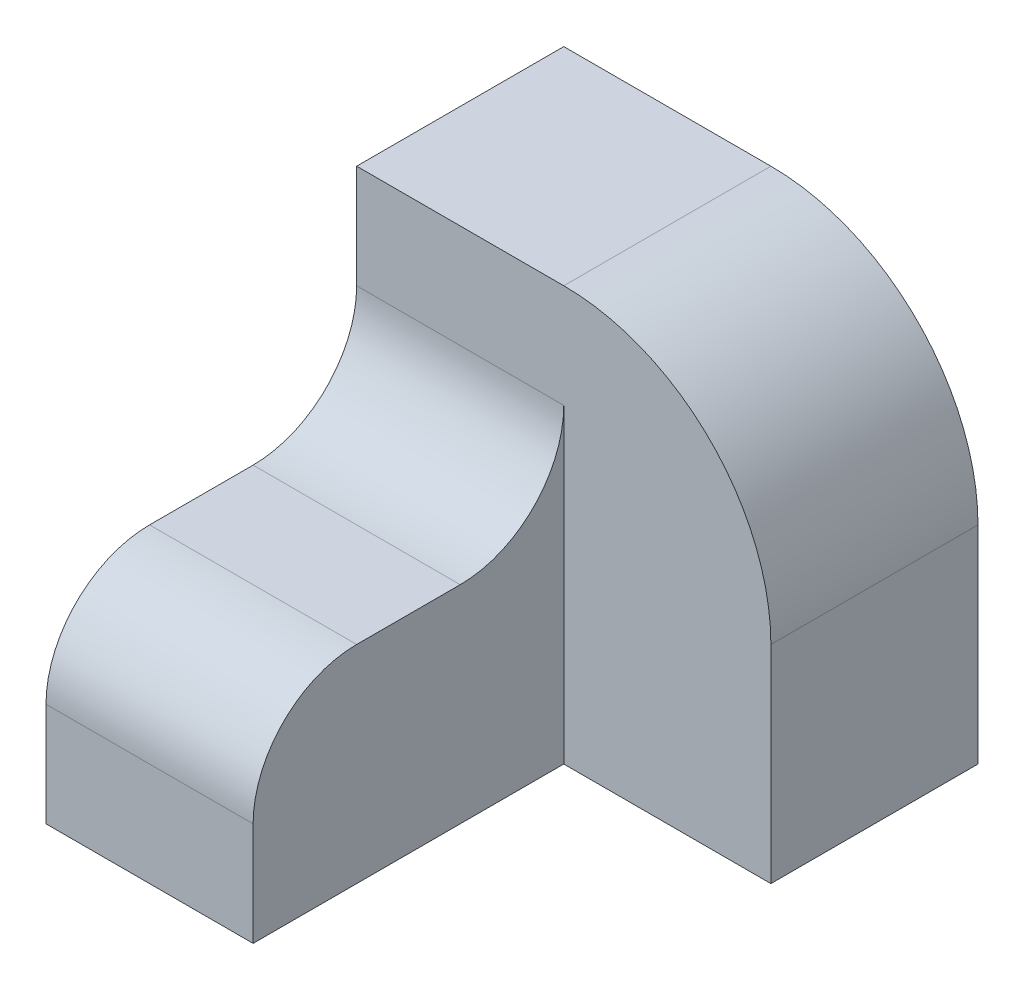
from build123d import *

# Parameters (mm, degrees)
SKETCH1_W      = 20
SKETCH1_H      = 20
EXTRUDE1_DEPTH = 50
EXTRUDE2_DEPTH = 20
FILLET1_R      = 10
FILLET2_R      = 20


with BuildPart() as part:
    # Sketch1 → Extrude1 (new body)
    with BuildSketch(Plane.XY):
        with Locations((10, 10)):
            Rectangle(SKETCH1_W, SKETCH1_H)
    extrude(amount=EXTRUDE1_DEPTH)

    # Sketch → Extrude2 (add)
    with BuildSketch(Plane.XY):
        Polygon((0, 40), (0, 20), (20, 20), (20, 0), (40, 0), (40, 40), align=None)
    extrude(amount=EXTRUDE2_DEPTH)

    # Fillet1
    fillet1_edges = [part.edges().sort_by_distance(p)[0] for p in [
        (10, 20, 20),
        (10, 20, 50),
    ]]
    fillet(fillet1_edges, radius=FILLET1_R)

    # Fillet2
    fillet2_edges = [part.edges().sort_by_distance(p)[0] for p in [
        (40, 40, 10),
    ]]
    fillet(fillet2_edges, radius=FILLET2_R)


solid = part.part
